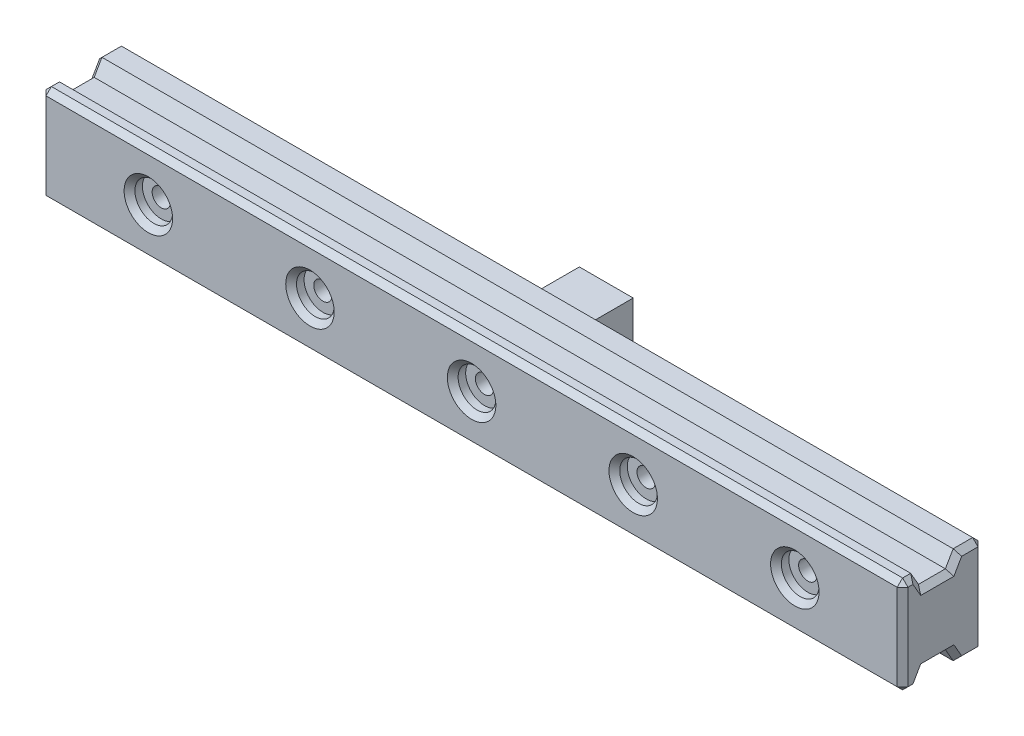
from build123d import *

# Parameters (mm, degrees)
SKETCH1_W                                = 160
SKETCH1_H                                = 18
BOSS_EXTRUDE1_DEPTH                      = 15
CUT_EXTRUDE1_DEPTH                       = 161.953409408
SKETCH3_W                                = 10
SKETCH3_H                                = 10
BOSS_EXTRUDE2_DEPTH                      = 10
CBORE_FOR_M3_PAN_HEAD_SCREW1_D           = 3.4
CBORE_FOR_M3_PAN_HEAD_SCREW1_CBORE_D     = 7
CBORE_FOR_M3_PAN_HEAD_SCREW1_CBORE_DEPTH = 2.4
CHAMFER1_SIZE                            = 1
LPATTERN2_COUNT                          = 3
LPATTERN2_PITCH                          = 30
LPATTERN3_COUNT                          = 3
LPATTERN3_PITCH                          = 30
CHAMFER2_SIZE                            = 1


with BuildPart() as part:
    # Sketch1 → Boss-Extrude1 (new body)
    with BuildSketch(Plane.XY):
        Rectangle(SKETCH1_W, SKETCH1_H)
    extrude(amount=BOSS_EXTRUDE1_DEPTH)

    # Sketch2 → Cut-Extrude1 (cut, through all)
    with BuildSketch(Plane(origin=(80, 0, 0), x_dir=(0, 0, -1), z_dir=(1, 0, 0))):
        Polygon((-12.5, 9), (-4.613248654, 9), (-6.056624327, 6.5), (-11.056624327, 6.5), align=None)
        Polygon((-11.056624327, -6.5), (-12.5, -9), (-4.613248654, -9), (-6.056624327, -6.5), align=None)
    extrude(amount=-CUT_EXTRUDE1_DEPTH, mode=Mode.SUBTRACT)

    # Sketch3 → Boss-Extrude2 (add)
    with BuildSketch(Plane(origin=(0, 0, 0), x_dir=(-1, 0, 0), z_dir=(0, 0, -1))):
        Rectangle(SKETCH3_W, SKETCH3_H)
    extrude(amount=BOSS_EXTRUDE2_DEPTH)

    # CBORE for M3 Pan Head Screw1 (through all)
    with Locations(Plane.XY.offset(15)):
        with Locations((0, 0)):
            cbore_for_m3_pan_head_screw1 = CounterBoreHole(CBORE_FOR_M3_PAN_HEAD_SCREW1_D / 2, CBORE_FOR_M3_PAN_HEAD_SCREW1_CBORE_D / 2, CBORE_FOR_M3_PAN_HEAD_SCREW1_CBORE_DEPTH)

    # Chamfer1
    chamfer1_edges = [part.edges().sort_by_distance(p)[0] for p in [
        (-80, 0, 15),
        (0, -9, 15),
        (80, -9, 2.306624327),
        (-80, -9, 2.306624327),
        (-80, 9, 2.306624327),
        (80, 9, 2.306624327),
        (-80, 7.75, 11.778312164),
        (-80, 7.75, 5.334936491),
        (-80, 6.5, 8.556624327),
        (80, 7.75, 11.778312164),
        (80, 6.5, 8.556624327),
        (80, 7.75, 5.334936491),
        (-80, -6.5, 8.556624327),
        (-80, -7.75, 5.334936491),
        (-80, -7.75, 11.778312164),
        (80, -6.5, 8.556624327),
        (80, -7.75, 11.778312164),
        (80, -7.75, 5.334936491),
        (80, 0, 15),
        (0, -9, 0),
        (-80, 0, 0),
        (0, 9, 0),
        (80, 0, 0),
        (-3.5, 0, 15),
        (0, 9, 15),
        (80, -9, 13.75),
        (-80, -9, 13.75),
        (-80, 9, 13.75),
        (80, 9, 13.75),
    ]]
    chamfer(chamfer1_edges, length=CHAMFER1_SIZE)

    # LPattern2: CBORE for M3 Pan Head Screw1 ×3
    with Locations(*[(i * LPATTERN2_PITCH, 0, 0) for i in range(1, LPATTERN2_COUNT)]):
        add(cbore_for_m3_pan_head_screw1, mode=Mode.SUBTRACT)

    # LPattern3: CBORE for M3 Pan Head Screw1 ×3
    with Locations(*[(-i * LPATTERN3_PITCH, 0, 0) for i in range(1, LPATTERN3_COUNT)]):
        add(cbore_for_m3_pan_head_screw1, mode=Mode.SUBTRACT)

    # Chamfer2
    chamfer2_edges = [part.edges().sort_by_distance(p)[0] for p in [
        (26.5, 0, 15),
        (56.5, 0, 15),
        (-33.5, 0, 15),
        (-63.5, 0, 15),
    ]]
    chamfer(chamfer2_edges, length=CHAMFER2_SIZE)


solid = part.part
